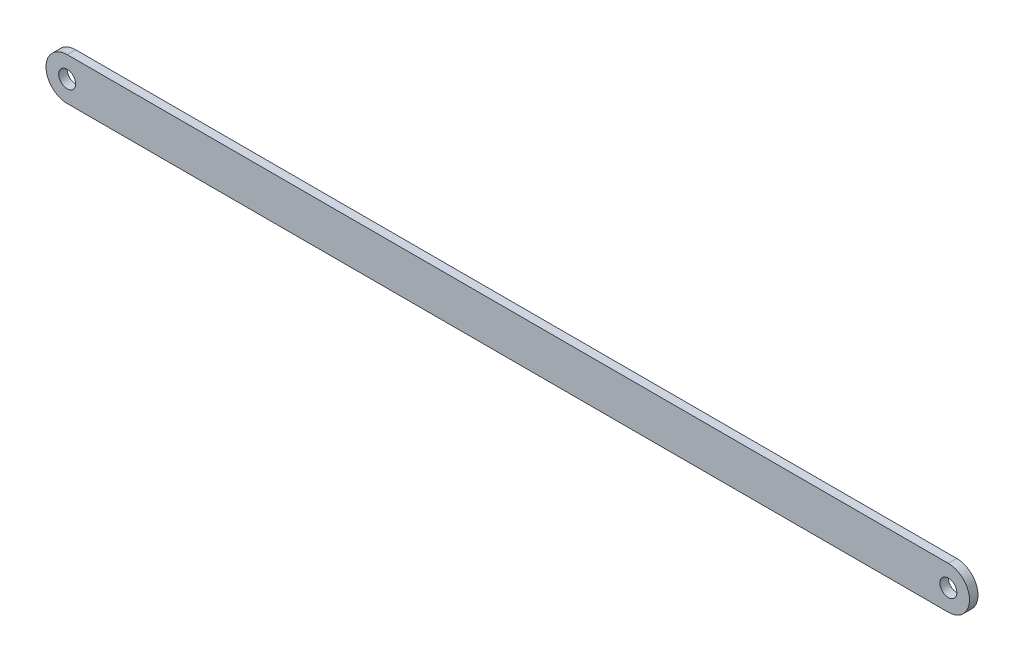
ISO-10303-21;
HEADER;
FILE_DESCRIPTION(('STEP AP214'),'2;1');
FILE_NAME('part.step','',(''),(''),'','','');
FILE_SCHEMA(('AUTOMOTIVE_DESIGN { 1 0 10303 214 1 1 1 1 }'));
ENDSEC;
DATA;
#1=APPLICATION_CONTEXT('core data for automotive mechanical design processes');
#2=APPLICATION_PROTOCOL_DEFINITION('international standard','automotive_design',2000,#1);
#3=PRODUCT_CONTEXT('',#1,'mechanical');
#4=PRODUCT('Part','Part','',(#3));
#5=PRODUCT_RELATED_PRODUCT_CATEGORY('part','',(#4));
#6=PRODUCT_DEFINITION_FORMATION('','',#4);
#7=PRODUCT_DEFINITION_CONTEXT('part definition',#1,'design');
#8=PRODUCT_DEFINITION('design','',#6,#7);
#9=PRODUCT_DEFINITION_SHAPE('','',#8);
#10=(LENGTH_UNIT() NAMED_UNIT(*) SI_UNIT(.MILLI.,.METRE.));
#11=(NAMED_UNIT(*) PLANE_ANGLE_UNIT() SI_UNIT($,.RADIAN.));
#12=(NAMED_UNIT(*) SI_UNIT($,.STERADIAN.) SOLID_ANGLE_UNIT());
#13=UNCERTAINTY_MEASURE_WITH_UNIT(LENGTH_MEASURE(1.E-05),#10,'distance_accuracy_value','');
#14=(GEOMETRIC_REPRESENTATION_CONTEXT(3) GLOBAL_UNCERTAINTY_ASSIGNED_CONTEXT((#13)) GLOBAL_UNIT_ASSIGNED_CONTEXT((#10,
#11,#12)) REPRESENTATION_CONTEXT('',''));
#15=CARTESIAN_POINT('',(0.,0.,0.));
#16=DIRECTION('',(0.,0.,1.));
#17=DIRECTION('',(1.,0.,0.));
#18=AXIS2_PLACEMENT_3D('',#15,#16,#17);
#19=CARTESIAN_POINT('',(-260.,12.5,5.));
#20=DIRECTION('',(0.,1.,0.));
#21=DIRECTION('',(-1.,0.,0.));
#22=AXIS2_PLACEMENT_3D('',#19,#20,#21);
#23=PLANE('',#22);
#24=DIRECTION('',(1.,0.,0.));
#25=VECTOR('',#24,1.);
#26=CARTESIAN_POINT('',(-260.,12.5,0.));
#27=LINE('',#26,#25);
#28=CARTESIAN_POINT('',(-260.,12.5,0.));
#29=VERTEX_POINT('',#28);
#30=CARTESIAN_POINT('',(260.,12.5,0.));
#31=VERTEX_POINT('',#30);
#32=EDGE_CURVE('E98',#29,#31,#27,.T.);
#33=ORIENTED_EDGE('',*,*,#32,.F.);
#34=DIRECTION('',(0.,0.,-1.));
#35=VECTOR('',#34,1.);
#36=CARTESIAN_POINT('',(-260.,12.5,5.));
#37=LINE('',#36,#35);
#38=CARTESIAN_POINT('',(-260.,12.5,5.));
#39=VERTEX_POINT('',#38);
#40=EDGE_CURVE('E11',#39,#29,#37,.T.);
#41=ORIENTED_EDGE('',*,*,#40,.F.);
#42=DIRECTION('',(1.,0.,0.));
#43=VECTOR('',#42,1.);
#44=CARTESIAN_POINT('',(-260.,12.5,5.));
#45=LINE('',#44,#43);
#46=CARTESIAN_POINT('',(260.,12.5,5.));
#47=VERTEX_POINT('',#46);
#48=EDGE_CURVE('E92',#39,#47,#45,.T.);
#49=ORIENTED_EDGE('',*,*,#48,.T.);
#50=DIRECTION('',(0.,0.,-1.));
#51=VECTOR('',#50,1.);
#52=CARTESIAN_POINT('',(260.,12.5,5.));
#53=LINE('',#52,#51);
#54=EDGE_CURVE('E35',#47,#31,#53,.T.);
#55=ORIENTED_EDGE('',*,*,#54,.T.);
#56=EDGE_LOOP('',(#33,#41,#49,#55));
#57=FACE_BOUND('',#56,.T.);
#58=ADVANCED_FACE('F32',(#57),#23,.T.);
#59=CARTESIAN_POINT('',(-260.,0.,5.));
#60=DIRECTION('',(0.,0.,-1.));
#61=DIRECTION('',(-1.,0.,0.));
#62=AXIS2_PLACEMENT_3D('',#59,#60,#61);
#63=CYLINDRICAL_SURFACE('',#62,12.5);
#64=CARTESIAN_POINT('',(-260.,0.,0.));
#65=DIRECTION('',(0.,0.,1.));
#66=DIRECTION('',(1.,0.,0.));
#67=AXIS2_PLACEMENT_3D('',#64,#65,#66);
#68=CIRCLE('',#67,12.5);
#69=CARTESIAN_POINT('',(-260.,-12.5,0.));
#70=VERTEX_POINT('',#69);
#71=EDGE_CURVE('E65',#29,#70,#68,.T.);
#72=ORIENTED_EDGE('',*,*,#71,.T.);
#73=DIRECTION('',(0.,0.,-1.));
#74=VECTOR('',#73,1.);
#75=CARTESIAN_POINT('',(-260.,-12.5,5.));
#76=LINE('',#75,#74);
#77=CARTESIAN_POINT('',(-260.,-12.5,5.));
#78=VERTEX_POINT('',#77);
#79=EDGE_CURVE('E41',#78,#70,#76,.T.);
#80=ORIENTED_EDGE('',*,*,#79,.F.);
#81=CARTESIAN_POINT('',(-260.,0.,5.));
#82=DIRECTION('',(0.,0.,1.));
#83=DIRECTION('',(1.,0.,0.));
#84=AXIS2_PLACEMENT_3D('',#81,#82,#83);
#85=CIRCLE('',#84,12.5);
#86=EDGE_CURVE('E80',#39,#78,#85,.T.);
#87=ORIENTED_EDGE('',*,*,#86,.F.);
#88=ORIENTED_EDGE('',*,*,#40,.T.);
#89=EDGE_LOOP('',(#72,#80,#87,#88));
#90=FACE_BOUND('',#89,.T.);
#91=ADVANCED_FACE('F109',(#90),#63,.T.);
#92=CARTESIAN_POINT('',(-260.,-12.5,5.));
#93=DIRECTION('',(0.,1.,0.));
#94=DIRECTION('',(-1.,0.,0.));
#95=AXIS2_PLACEMENT_3D('',#92,#93,#94);
#96=PLANE('',#95);
#97=DIRECTION('',(1.,0.,0.));
#98=VECTOR('',#97,1.);
#99=CARTESIAN_POINT('',(-260.,-12.5,0.));
#100=LINE('',#99,#98);
#101=CARTESIAN_POINT('',(260.,-12.4999999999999,0.));
#102=VERTEX_POINT('',#101);
#103=EDGE_CURVE('E87',#70,#102,#100,.T.);
#104=ORIENTED_EDGE('',*,*,#103,.T.);
#105=DIRECTION('',(0.,0.,-1.));
#106=VECTOR('',#105,1.);
#107=CARTESIAN_POINT('',(260.,-12.4999999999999,5.));
#108=LINE('',#107,#106);
#109=CARTESIAN_POINT('',(260.,-12.4999999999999,5.));
#110=VERTEX_POINT('',#109);
#111=EDGE_CURVE('E84',#110,#102,#108,.T.);
#112=ORIENTED_EDGE('',*,*,#111,.F.);
#113=DIRECTION('',(1.,0.,0.));
#114=VECTOR('',#113,1.);
#115=CARTESIAN_POINT('',(-260.,-12.5,5.));
#116=LINE('',#115,#114);
#117=EDGE_CURVE('E77',#78,#110,#116,.T.);
#118=ORIENTED_EDGE('',*,*,#117,.F.);
#119=ORIENTED_EDGE('',*,*,#79,.T.);
#120=EDGE_LOOP('',(#104,#112,#118,#119));
#121=FACE_BOUND('',#120,.T.);
#122=ADVANCED_FACE('F85',(#121),#96,.F.);
#123=CARTESIAN_POINT('',(260.,0.,5.));
#124=DIRECTION('',(0.,0.,-1.));
#125=DIRECTION('',(-1.,0.,0.));
#126=AXIS2_PLACEMENT_3D('',#123,#124,#125);
#127=CYLINDRICAL_SURFACE('',#126,12.5);
#128=CARTESIAN_POINT('',(260.,0.,0.));
#129=DIRECTION('',(0.,0.,1.));
#130=DIRECTION('',(1.,0.,0.));
#131=AXIS2_PLACEMENT_3D('',#128,#129,#130);
#132=CIRCLE('',#131,12.5);
#133=EDGE_CURVE('E101',#102,#31,#132,.T.);
#134=ORIENTED_EDGE('',*,*,#133,.T.);
#135=ORIENTED_EDGE('',*,*,#54,.F.);
#136=CARTESIAN_POINT('',(260.,0.,5.));
#137=DIRECTION('',(0.,0.,1.));
#138=DIRECTION('',(1.,0.,0.));
#139=AXIS2_PLACEMENT_3D('',#136,#137,#138);
#140=CIRCLE('',#139,12.5);
#141=EDGE_CURVE('E74',#110,#47,#140,.T.);
#142=ORIENTED_EDGE('',*,*,#141,.F.);
#143=ORIENTED_EDGE('',*,*,#111,.T.);
#144=EDGE_LOOP('',(#134,#135,#142,#143));
#145=FACE_BOUND('',#144,.T.);
#146=ADVANCED_FACE('F91',(#145),#127,.T.);
#147=CARTESIAN_POINT('',(260.,0.,5.));
#148=DIRECTION('',(0.,0.,1.));
#149=DIRECTION('',(1.,0.,0.));
#150=AXIS2_PLACEMENT_3D('',#147,#148,#149);
#151=PLANE('',#150);
#152=CARTESIAN_POINT('',(260.,0.,5.));
#153=DIRECTION('',(0.,0.,1.));
#154=DIRECTION('',(1.,0.,0.));
#155=AXIS2_PLACEMENT_3D('',#152,#153,#154);
#156=CIRCLE('',#155,5.);
#157=CARTESIAN_POINT('',(265.,0.,5.));
#158=VERTEX_POINT('',#157);
#159=EDGE_CURVE('E146',#158,#158,#156,.T.);
#160=ORIENTED_EDGE('',*,*,#159,.F.);
#161=EDGE_LOOP('',(#160));
#162=FACE_BOUND('',#161,.T.);
#163=CARTESIAN_POINT('',(-260.,0.,5.));
#164=DIRECTION('',(0.,0.,1.));
#165=DIRECTION('',(1.,0.,0.));
#166=AXIS2_PLACEMENT_3D('',#163,#164,#165);
#167=CIRCLE('',#166,5.);
#168=CARTESIAN_POINT('',(-255.,0.,5.));
#169=VERTEX_POINT('',#168);
#170=EDGE_CURVE('E148',#169,#169,#167,.T.);
#171=ORIENTED_EDGE('',*,*,#170,.F.);
#172=EDGE_LOOP('',(#171));
#173=FACE_BOUND('',#172,.T.);
#174=ORIENTED_EDGE('',*,*,#48,.F.);
#175=ORIENTED_EDGE('',*,*,#86,.T.);
#176=ORIENTED_EDGE('',*,*,#117,.T.);
#177=ORIENTED_EDGE('',*,*,#141,.T.);
#178=EDGE_LOOP('',(#174,#175,#176,#177));
#179=FACE_BOUND('',#178,.T.);
#180=ADVANCED_FACE('F79',(#162,#173,#179),#151,.T.);
#181=CARTESIAN_POINT('',(260.,0.,0.));
#182=DIRECTION('',(0.,0.,1.));
#183=DIRECTION('',(1.,0.,0.));
#184=AXIS2_PLACEMENT_3D('',#181,#182,#183);
#185=PLANE('',#184);
#186=CARTESIAN_POINT('',(260.,0.,0.));
#187=DIRECTION('',(0.,0.,1.));
#188=DIRECTION('',(1.,0.,0.));
#189=AXIS2_PLACEMENT_3D('',#186,#187,#188);
#190=CIRCLE('',#189,5.);
#191=CARTESIAN_POINT('',(265.,0.,0.));
#192=VERTEX_POINT('',#191);
#193=EDGE_CURVE('E144',#192,#192,#190,.T.);
#194=ORIENTED_EDGE('',*,*,#193,.T.);
#195=EDGE_LOOP('',(#194));
#196=FACE_BOUND('',#195,.T.);
#197=CARTESIAN_POINT('',(-260.,0.,0.));
#198=DIRECTION('',(0.,0.,1.));
#199=DIRECTION('',(1.,0.,0.));
#200=AXIS2_PLACEMENT_3D('',#197,#198,#199);
#201=CIRCLE('',#200,5.);
#202=CARTESIAN_POINT('',(-255.,0.,0.));
#203=VERTEX_POINT('',#202);
#204=EDGE_CURVE('E102',#203,#203,#201,.T.);
#205=ORIENTED_EDGE('',*,*,#204,.T.);
#206=EDGE_LOOP('',(#205));
#207=FACE_BOUND('',#206,.T.);
#208=ORIENTED_EDGE('',*,*,#32,.T.);
#209=ORIENTED_EDGE('',*,*,#133,.F.);
#210=ORIENTED_EDGE('',*,*,#103,.F.);
#211=ORIENTED_EDGE('',*,*,#71,.F.);
#212=EDGE_LOOP('',(#208,#209,#210,#211));
#213=FACE_BOUND('',#212,.T.);
#214=ADVANCED_FACE('F107',(#196,#207,#213),#185,.F.);
#215=CARTESIAN_POINT('',(-260.,0.,5.));
#216=DIRECTION('',(0.,0.,1.));
#217=DIRECTION('',(1.,0.,0.));
#218=AXIS2_PLACEMENT_3D('',#215,#216,#217);
#219=CYLINDRICAL_SURFACE('',#218,5.);
#220=ORIENTED_EDGE('',*,*,#204,.F.);
#221=EDGE_LOOP('',(#220));
#222=FACE_BOUND('',#221,.T.);
#223=ORIENTED_EDGE('',*,*,#170,.T.);
#224=EDGE_LOOP('',(#223));
#225=FACE_BOUND('',#224,.T.);
#226=ADVANCED_FACE('F128',(#222,#225),#219,.F.);
#227=CARTESIAN_POINT('',(260.,0.,5.));
#228=DIRECTION('',(0.,0.,1.));
#229=DIRECTION('',(1.,0.,0.));
#230=AXIS2_PLACEMENT_3D('',#227,#228,#229);
#231=CYLINDRICAL_SURFACE('',#230,5.);
#232=ORIENTED_EDGE('',*,*,#193,.F.);
#233=EDGE_LOOP('',(#232));
#234=FACE_BOUND('',#233,.T.);
#235=ORIENTED_EDGE('',*,*,#159,.T.);
#236=EDGE_LOOP('',(#235));
#237=FACE_BOUND('',#236,.T.);
#238=ADVANCED_FACE('F135',(#234,#237),#231,.F.);
#239=CLOSED_SHELL('',(#58,#91,#122,#146,#180,#214,#226,#238));
#240=MANIFOLD_SOLID_BREP('B2',#239);
#241=ADVANCED_BREP_SHAPE_REPRESENTATION('',(#18,#240),#14);
#242=SHAPE_DEFINITION_REPRESENTATION(#9,#241);
ENDSEC;
END-ISO-10303-21;
